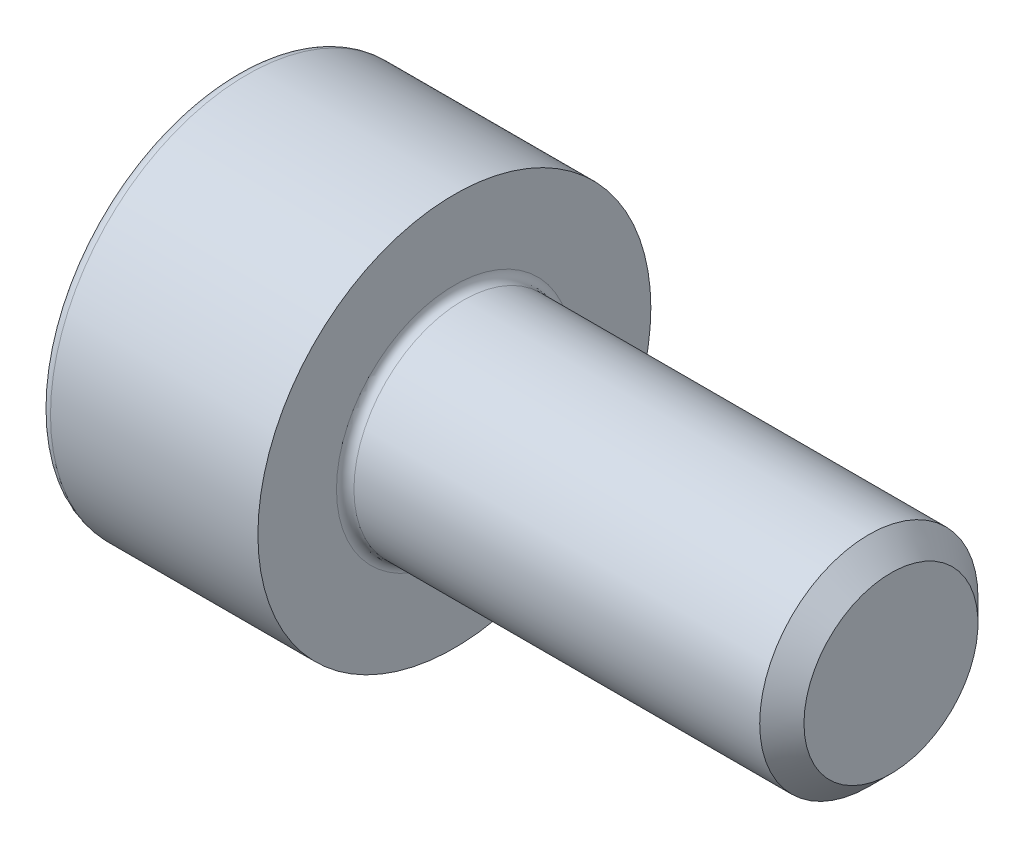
ISO-10303-21;
HEADER;
FILE_DESCRIPTION(('STEP AP214'),'2;1');
FILE_NAME('part.step','',(''),(''),'','','');
FILE_SCHEMA(('AUTOMOTIVE_DESIGN { 1 0 10303 214 1 1 1 1 }'));
ENDSEC;
DATA;
#1=APPLICATION_CONTEXT('core data for automotive mechanical design processes');
#2=APPLICATION_PROTOCOL_DEFINITION('international standard','automotive_design',2000,#1);
#3=PRODUCT_CONTEXT('',#1,'mechanical');
#4=PRODUCT('Part','Part','',(#3));
#5=PRODUCT_RELATED_PRODUCT_CATEGORY('part','',(#4));
#6=PRODUCT_DEFINITION_FORMATION('','',#4);
#7=PRODUCT_DEFINITION_CONTEXT('part definition',#1,'design');
#8=PRODUCT_DEFINITION('design','',#6,#7);
#9=PRODUCT_DEFINITION_SHAPE('','',#8);
#10=(LENGTH_UNIT() NAMED_UNIT(*) SI_UNIT(.MILLI.,.METRE.));
#11=(NAMED_UNIT(*) PLANE_ANGLE_UNIT() SI_UNIT($,.RADIAN.));
#12=(NAMED_UNIT(*) SI_UNIT($,.STERADIAN.) SOLID_ANGLE_UNIT());
#13=UNCERTAINTY_MEASURE_WITH_UNIT(LENGTH_MEASURE(1.E-05),#10,'distance_accuracy_value','');
#14=(GEOMETRIC_REPRESENTATION_CONTEXT(3) GLOBAL_UNCERTAINTY_ASSIGNED_CONTEXT((#13)) GLOBAL_UNIT_ASSIGNED_CONTEXT((#10,
#11,#12)) REPRESENTATION_CONTEXT('',''));
#15=CARTESIAN_POINT('',(0.,0.,0.));
#16=DIRECTION('',(0.,0.,1.));
#17=DIRECTION('',(1.,0.,0.));
#18=AXIS2_PLACEMENT_3D('',#15,#16,#17);
#19=CARTESIAN_POINT('',(0.,0.,0.));
#20=DIRECTION('',(-1.,0.,0.));
#21=DIRECTION('',(0.,0.,1.));
#22=AXIS2_PLACEMENT_3D('',#19,#20,#21);
#23=PLANE('',#22);
#24=DIRECTION('',(0.,-0.499999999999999,0.866025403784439));
#25=VECTOR('',#24,1.);
#26=CARTESIAN_POINT('',(0.,1.18068130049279,0.));
#27=LINE('',#26,#25);
#28=CARTESIAN_POINT('',(0.,1.18068130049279,0.));
#29=VERTEX_POINT('',#28);
#30=CARTESIAN_POINT('',(0.,0.590340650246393,1.02249999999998));
#31=VERTEX_POINT('',#30);
#32=EDGE_CURVE('E116',#29,#31,#27,.T.);
#33=ORIENTED_EDGE('',*,*,#32,.T.);
#34=DIRECTION('',(0.,1.,0.));
#35=VECTOR('',#34,1.);
#36=CARTESIAN_POINT('',(0.,-0.590340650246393,1.02249999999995));
#37=LINE('',#36,#35);
#38=CARTESIAN_POINT('',(0.,-0.590340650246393,1.02249999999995));
#39=VERTEX_POINT('',#38);
#40=EDGE_CURVE('E105',#39,#31,#37,.T.);
#41=ORIENTED_EDGE('',*,*,#40,.F.);
#42=DIRECTION('',(0.,-0.500000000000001,-0.866025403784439));
#43=VECTOR('',#42,1.);
#44=CARTESIAN_POINT('',(0.,-0.590340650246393,1.02249999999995));
#45=LINE('',#44,#43);
#46=CARTESIAN_POINT('',(0.,-1.18068130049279,0.));
#47=VERTEX_POINT('',#46);
#48=EDGE_CURVE('E115',#39,#47,#45,.T.);
#49=ORIENTED_EDGE('',*,*,#48,.T.);
#50=DIRECTION('',(0.,0.499999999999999,-0.866025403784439));
#51=VECTOR('',#50,1.);
#52=CARTESIAN_POINT('',(0.,-1.18068130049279,0.));
#53=LINE('',#52,#51);
#54=CARTESIAN_POINT('',(0.,-0.590340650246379,-1.02250000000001));
#55=VERTEX_POINT('',#54);
#56=EDGE_CURVE('E134',#47,#55,#53,.T.);
#57=ORIENTED_EDGE('',*,*,#56,.T.);
#58=DIRECTION('',(0.,-1.,0.));
#59=VECTOR('',#58,1.);
#60=CARTESIAN_POINT('',(0.,0.590340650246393,-1.02250000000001));
#61=LINE('',#60,#59);
#62=CARTESIAN_POINT('',(0.,0.590340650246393,-1.02250000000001));
#63=VERTEX_POINT('',#62);
#64=EDGE_CURVE('E137',#63,#55,#61,.T.);
#65=ORIENTED_EDGE('',*,*,#64,.F.);
#66=DIRECTION('',(0.,-0.500000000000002,-0.866025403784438));
#67=VECTOR('',#66,1.);
#68=CARTESIAN_POINT('',(0.,1.18068130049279,0.));
#69=LINE('',#68,#67);
#70=EDGE_CURVE('E130',#29,#63,#69,.T.);
#71=ORIENTED_EDGE('',*,*,#70,.F.);
#72=EDGE_LOOP('',(#33,#41,#49,#57,#65,#71));
#73=FACE_BOUND('',#72,.T.);
#74=CARTESIAN_POINT('',(0.,0.,0.));
#75=DIRECTION('',(-1.,0.,0.));
#76=DIRECTION('',(0.,0.,1.));
#77=AXIS2_PLACEMENT_3D('',#74,#75,#76);
#78=CIRCLE('',#77,2.125);
#79=CARTESIAN_POINT('',(0.,0.,2.125));
#80=VERTEX_POINT('',#79);
#81=EDGE_CURVE('E41',#80,#80,#78,.T.);
#82=ORIENTED_EDGE('',*,*,#81,.T.);
#83=EDGE_LOOP('',(#82));
#84=FACE_BOUND('',#83,.T.);
#85=ADVANCED_FACE('F34',(#73,#84),#23,.T.);
#86=CARTESIAN_POINT('',(-31.75,0.,0.));
#87=DIRECTION('',(-1.,0.,0.));
#88=DIRECTION('',(0.,0.,1.));
#89=AXIS2_PLACEMENT_3D('',#86,#87,#88);
#90=CYLINDRICAL_SURFACE('',#89,2.25);
#91=CARTESIAN_POINT('',(0.125000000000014,0.,0.));
#92=DIRECTION('',(-1.,0.,0.));
#93=DIRECTION('',(0.,0.,1.));
#94=AXIS2_PLACEMENT_3D('',#91,#92,#93);
#95=CIRCLE('',#94,2.25);
#96=CARTESIAN_POINT('',(0.125000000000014,0.,2.25));
#97=VERTEX_POINT('',#96);
#98=EDGE_CURVE('E11',#97,#97,#95,.F.);
#99=ORIENTED_EDGE('',*,*,#98,.T.);
#100=EDGE_LOOP('',(#99));
#101=FACE_BOUND('',#100,.T.);
#102=CARTESIAN_POINT('',(2.5,0.,0.));
#103=DIRECTION('',(-1.,0.,0.));
#104=DIRECTION('',(0.,0.,1.));
#105=AXIS2_PLACEMENT_3D('',#102,#103,#104);
#106=CIRCLE('',#105,2.25);
#107=CARTESIAN_POINT('',(2.5,0.,2.25));
#108=VERTEX_POINT('',#107);
#109=EDGE_CURVE('E182',#108,#108,#106,.T.);
#110=ORIENTED_EDGE('',*,*,#109,.T.);
#111=EDGE_LOOP('',(#110));
#112=FACE_BOUND('',#111,.T.);
#113=ADVANCED_FACE('F209',(#101,#112),#90,.T.);
#114=CARTESIAN_POINT('',(2.5,2.25,0.));
#115=DIRECTION('',(1.,0.,0.));
#116=DIRECTION('',(0.,0.,-1.));
#117=AXIS2_PLACEMENT_3D('',#114,#115,#116);
#118=PLANE('',#117);
#119=CARTESIAN_POINT('',(2.5,0.,0.));
#120=DIRECTION('',(1.,0.,0.));
#121=DIRECTION('',(0.,0.,-1.));
#122=AXIS2_PLACEMENT_3D('',#119,#120,#121);
#123=CIRCLE('',#122,1.35);
#124=CARTESIAN_POINT('',(2.5,0.,-1.35));
#125=VERTEX_POINT('',#124);
#126=EDGE_CURVE('E185',#125,#125,#123,.F.);
#127=ORIENTED_EDGE('',*,*,#126,.T.);
#128=EDGE_LOOP('',(#127));
#129=FACE_BOUND('',#128,.T.);
#130=ORIENTED_EDGE('',*,*,#109,.F.);
#131=EDGE_LOOP('',(#130));
#132=FACE_BOUND('',#131,.T.);
#133=ADVANCED_FACE('F213',(#129,#132),#118,.T.);
#134=CARTESIAN_POINT('',(-31.75,0.,0.));
#135=DIRECTION('',(-1.,0.,0.));
#136=DIRECTION('',(0.,0.,1.));
#137=AXIS2_PLACEMENT_3D('',#134,#135,#136);
#138=CYLINDRICAL_SURFACE('',#137,1.25);
#139=CARTESIAN_POINT('',(2.59999999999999,0.,0.));
#140=DIRECTION('',(1.,0.,0.));
#141=DIRECTION('',(0.,0.,-1.));
#142=AXIS2_PLACEMENT_3D('',#139,#140,#141);
#143=CIRCLE('',#142,1.25);
#144=CARTESIAN_POINT('',(2.59999999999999,0.,-1.25));
#145=VERTEX_POINT('',#144);
#146=EDGE_CURVE('E188',#145,#145,#143,.T.);
#147=ORIENTED_EDGE('',*,*,#146,.T.);
#148=EDGE_LOOP('',(#147));
#149=FACE_BOUND('',#148,.T.);
#150=CARTESIAN_POINT('',(7.24649999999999,0.,0.));
#151=DIRECTION('',(-1.,0.,0.));
#152=DIRECTION('',(0.,0.,1.));
#153=AXIS2_PLACEMENT_3D('',#150,#151,#152);
#154=CIRCLE('',#153,1.25);
#155=CARTESIAN_POINT('',(7.24649999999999,0.,1.25));
#156=VERTEX_POINT('',#155);
#157=EDGE_CURVE('E179',#156,#156,#154,.T.);
#158=ORIENTED_EDGE('',*,*,#157,.T.);
#159=EDGE_LOOP('',(#158));
#160=FACE_BOUND('',#159,.T.);
#161=ADVANCED_FACE('F218',(#149,#160),#138,.T.);
#162=CARTESIAN_POINT('',(7.50000000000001,0.,0.));
#163=DIRECTION('',(-1.,0.,0.));
#164=DIRECTION('',(0.,0.,1.));
#165=AXIS2_PLACEMENT_3D('',#162,#163,#164);
#166=CONICAL_SURFACE('',#165,0.9965,0.785398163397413);
#167=ORIENTED_EDGE('',*,*,#157,.F.);
#168=EDGE_LOOP('',(#167));
#169=FACE_BOUND('',#168,.T.);
#170=CARTESIAN_POINT('',(7.50000000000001,0.,0.));
#171=DIRECTION('',(-1.,0.,0.));
#172=DIRECTION('',(0.,0.,1.));
#173=AXIS2_PLACEMENT_3D('',#170,#171,#172);
#174=CIRCLE('',#173,0.9965);
#175=CARTESIAN_POINT('',(7.50000000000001,0.,0.996500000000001));
#176=VERTEX_POINT('',#175);
#177=EDGE_CURVE('E175',#176,#176,#174,.T.);
#178=ORIENTED_EDGE('',*,*,#177,.T.);
#179=EDGE_LOOP('',(#178));
#180=FACE_BOUND('',#179,.T.);
#181=ADVANCED_FACE('F225',(#169,#180),#166,.T.);
#182=CARTESIAN_POINT('',(7.50000000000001,0.996500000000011,0.));
#183=DIRECTION('',(1.,0.,0.));
#184=DIRECTION('',(0.,0.,-1.));
#185=AXIS2_PLACEMENT_3D('',#182,#183,#184);
#186=PLANE('',#185);
#187=ORIENTED_EDGE('',*,*,#177,.F.);
#188=EDGE_LOOP('',(#187));
#189=FACE_BOUND('',#188,.T.);
#190=ADVANCED_FACE('F203',(#189),#186,.T.);
#191=CARTESIAN_POINT('',(2.59999999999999,0.,0.));
#192=DIRECTION('',(1.,0.,0.));
#193=DIRECTION('',(0.,0.,-1.));
#194=AXIS2_PLACEMENT_3D('',#191,#192,#193);
#195=TOROIDAL_SURFACE('',#194,1.35,0.1);
#196=ORIENTED_EDGE('',*,*,#146,.F.);
#197=EDGE_LOOP('',(#196));
#198=FACE_BOUND('',#197,.T.);
#199=ORIENTED_EDGE('',*,*,#126,.F.);
#200=EDGE_LOOP('',(#199));
#201=FACE_BOUND('',#200,.T.);
#202=ADVANCED_FACE('F195',(#198,#201),#195,.F.);
#203=CARTESIAN_POINT('',(0.125000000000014,0.,0.));
#204=DIRECTION('',(-1.,0.,0.));
#205=DIRECTION('',(0.,0.,1.));
#206=AXIS2_PLACEMENT_3D('',#203,#204,#205);
#207=TOROIDAL_SURFACE('',#206,2.125,0.125);
#208=ORIENTED_EDGE('',*,*,#98,.F.);
#209=EDGE_LOOP('',(#208));
#210=FACE_BOUND('',#209,.T.);
#211=ORIENTED_EDGE('',*,*,#81,.F.);
#212=EDGE_LOOP('',(#211));
#213=FACE_BOUND('',#212,.T.);
#214=ADVANCED_FACE('F193',(#210,#213),#207,.T.);
#215=CARTESIAN_POINT('',(1.09999999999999,1.18068130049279,0.));
#216=DIRECTION('',(0.,-0.866025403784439,-0.5));
#217=DIRECTION('',(0.,0.499999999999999,-0.86602540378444));
#218=AXIS2_PLACEMENT_3D('',#215,#216,#217);
#219=PLANE('',#218);
#220=ORIENTED_EDGE('',*,*,#32,.F.);
#221=DIRECTION('',(-1.,0.,0.));
#222=VECTOR('',#221,1.);
#223=CARTESIAN_POINT('',(1.09999999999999,1.18068130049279,0.));
#224=LINE('',#223,#222);
#225=CARTESIAN_POINT('',(1.09999999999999,1.18068130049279,0.));
#226=VERTEX_POINT('',#225);
#227=EDGE_CURVE('E160',#226,#29,#224,.T.);
#228=ORIENTED_EDGE('',*,*,#227,.F.);
#229=DIRECTION('',(0.,-0.499999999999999,0.866025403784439));
#230=VECTOR('',#229,1.);
#231=CARTESIAN_POINT('',(1.09999999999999,1.18068130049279,0.));
#232=LINE('',#231,#230);
#233=CARTESIAN_POINT('',(1.09999999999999,0.885510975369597,0.511250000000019));
#234=VERTEX_POINT('',#233);
#235=EDGE_CURVE('E140',#226,#234,#232,.T.);
#236=ORIENTED_EDGE('',*,*,#235,.T.);
#237=CARTESIAN_POINT('',(1.09999999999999,0.590340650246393,1.02249999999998));
#238=VERTEX_POINT('',#237);
#239=EDGE_CURVE('E124',#234,#238,#232,.T.);
#240=ORIENTED_EDGE('',*,*,#239,.T.);
#241=DIRECTION('',(-1.,0.,0.));
#242=VECTOR('',#241,1.);
#243=CARTESIAN_POINT('',(1.09999999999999,0.590340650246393,1.02249999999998));
#244=LINE('',#243,#242);
#245=EDGE_CURVE('E109',#238,#31,#244,.T.);
#246=ORIENTED_EDGE('',*,*,#245,.T.);
#247=EDGE_LOOP('',(#220,#228,#236,#240,#246));
#248=FACE_BOUND('',#247,.T.);
#249=ADVANCED_FACE('F120',(#248),#219,.T.);
#250=CARTESIAN_POINT('',(1.09999999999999,-0.590340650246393,1.02249999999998));
#251=DIRECTION('',(0.,0.,1.));
#252=DIRECTION('',(0.,-1.,0.));
#253=AXIS2_PLACEMENT_3D('',#250,#251,#252);
#254=PLANE('',#253);
#255=ORIENTED_EDGE('',*,*,#40,.T.);
#256=ORIENTED_EDGE('',*,*,#245,.F.);
#257=DIRECTION('',(0.,1.,0.));
#258=VECTOR('',#257,1.);
#259=CARTESIAN_POINT('',(1.09999999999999,-0.590340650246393,1.02249999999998));
#260=LINE('',#259,#258);
#261=CARTESIAN_POINT('',(1.09999999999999,0.,1.02249999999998));
#262=VERTEX_POINT('',#261);
#263=EDGE_CURVE('E142',#262,#238,#260,.T.);
#264=ORIENTED_EDGE('',*,*,#263,.F.);
#265=CARTESIAN_POINT('',(1.09999999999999,-0.590340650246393,1.02249999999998));
#266=VERTEX_POINT('',#265);
#267=EDGE_CURVE('E143',#266,#262,#260,.T.);
#268=ORIENTED_EDGE('',*,*,#267,.F.);
#269=DIRECTION('',(-1.,0.,0.));
#270=VECTOR('',#269,1.);
#271=CARTESIAN_POINT('',(1.09999999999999,-0.590340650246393,1.02249999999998));
#272=LINE('',#271,#270);
#273=EDGE_CURVE('E111',#266,#39,#272,.T.);
#274=ORIENTED_EDGE('',*,*,#273,.T.);
#275=EDGE_LOOP('',(#255,#256,#264,#268,#274));
#276=FACE_BOUND('',#275,.T.);
#277=ADVANCED_FACE('F107',(#276),#254,.F.);
#278=CARTESIAN_POINT('',(1.09999999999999,-0.590340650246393,1.02249999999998));
#279=DIRECTION('',(0.,0.866025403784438,-0.500000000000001));
#280=DIRECTION('',(0.,0.500000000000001,0.866025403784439));
#281=AXIS2_PLACEMENT_3D('',#278,#279,#280);
#282=PLANE('',#281);
#283=ORIENTED_EDGE('',*,*,#48,.F.);
#284=ORIENTED_EDGE('',*,*,#273,.F.);
#285=DIRECTION('',(0.,-0.500000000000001,-0.866025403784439));
#286=VECTOR('',#285,1.);
#287=CARTESIAN_POINT('',(1.09999999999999,-0.590340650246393,1.02249999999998));
#288=LINE('',#287,#286);
#289=CARTESIAN_POINT('',(1.09999999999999,-0.885510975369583,0.511250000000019));
#290=VERTEX_POINT('',#289);
#291=EDGE_CURVE('E147',#266,#290,#288,.T.);
#292=ORIENTED_EDGE('',*,*,#291,.T.);
#293=CARTESIAN_POINT('',(1.09999999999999,-1.18068130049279,0.));
#294=VERTEX_POINT('',#293);
#295=EDGE_CURVE('E146',#290,#294,#288,.T.);
#296=ORIENTED_EDGE('',*,*,#295,.T.);
#297=DIRECTION('',(-1.,0.,0.));
#298=VECTOR('',#297,1.);
#299=CARTESIAN_POINT('',(1.09999999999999,-1.18068130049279,0.));
#300=LINE('',#299,#298);
#301=EDGE_CURVE('E168',#294,#47,#300,.T.);
#302=ORIENTED_EDGE('',*,*,#301,.T.);
#303=EDGE_LOOP('',(#283,#284,#292,#296,#302));
#304=FACE_BOUND('',#303,.T.);
#305=ADVANCED_FACE('F263',(#304),#282,.T.);
#306=CARTESIAN_POINT('',(1.09999999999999,-1.18068130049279,0.));
#307=DIRECTION('',(0.,0.86602540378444,0.5));
#308=DIRECTION('',(0.,-0.499999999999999,0.86602540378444));
#309=AXIS2_PLACEMENT_3D('',#306,#307,#308);
#310=PLANE('',#309);
#311=ORIENTED_EDGE('',*,*,#56,.F.);
#312=ORIENTED_EDGE('',*,*,#301,.F.);
#313=DIRECTION('',(0.,0.499999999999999,-0.866025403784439));
#314=VECTOR('',#313,1.);
#315=CARTESIAN_POINT('',(1.09999999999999,-1.18068130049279,0.));
#316=LINE('',#315,#314);
#317=CARTESIAN_POINT('',(1.09999999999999,-0.885510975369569,-0.511250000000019));
#318=VERTEX_POINT('',#317);
#319=EDGE_CURVE('E151',#294,#318,#316,.T.);
#320=ORIENTED_EDGE('',*,*,#319,.T.);
#321=CARTESIAN_POINT('',(1.09999999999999,-0.590340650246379,-1.02250000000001));
#322=VERTEX_POINT('',#321);
#323=EDGE_CURVE('E150',#318,#322,#316,.T.);
#324=ORIENTED_EDGE('',*,*,#323,.T.);
#325=DIRECTION('',(-1.,0.,0.));
#326=VECTOR('',#325,1.);
#327=CARTESIAN_POINT('',(1.09999999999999,-0.590340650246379,-1.02250000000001));
#328=LINE('',#327,#326);
#329=EDGE_CURVE('E165',#322,#55,#328,.T.);
#330=ORIENTED_EDGE('',*,*,#329,.T.);
#331=EDGE_LOOP('',(#311,#312,#320,#324,#330));
#332=FACE_BOUND('',#331,.T.);
#333=ADVANCED_FACE('F272',(#332),#310,.T.);
#334=CARTESIAN_POINT('',(1.09999999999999,0.590340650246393,-1.02250000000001));
#335=DIRECTION('',(0.,0.,-1.));
#336=DIRECTION('',(0.,1.,0.));
#337=AXIS2_PLACEMENT_3D('',#334,#335,#336);
#338=PLANE('',#337);
#339=ORIENTED_EDGE('',*,*,#64,.T.);
#340=ORIENTED_EDGE('',*,*,#329,.F.);
#341=DIRECTION('',(0.,-1.,0.));
#342=VECTOR('',#341,1.);
#343=CARTESIAN_POINT('',(1.09999999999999,0.590340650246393,-1.02250000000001));
#344=LINE('',#343,#342);
#345=CARTESIAN_POINT('',(1.09999999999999,0.,-1.02249999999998));
#346=VERTEX_POINT('',#345);
#347=EDGE_CURVE('E154',#346,#322,#344,.T.);
#348=ORIENTED_EDGE('',*,*,#347,.F.);
#349=CARTESIAN_POINT('',(1.09999999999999,0.590340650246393,-1.02250000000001));
#350=VERTEX_POINT('',#349);
#351=EDGE_CURVE('E48',#350,#346,#344,.T.);
#352=ORIENTED_EDGE('',*,*,#351,.F.);
#353=DIRECTION('',(-1.,0.,0.));
#354=VECTOR('',#353,1.);
#355=CARTESIAN_POINT('',(1.09999999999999,0.590340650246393,-1.02250000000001));
#356=LINE('',#355,#354);
#357=EDGE_CURVE('E162',#350,#63,#356,.T.);
#358=ORIENTED_EDGE('',*,*,#357,.T.);
#359=EDGE_LOOP('',(#339,#340,#348,#352,#358));
#360=FACE_BOUND('',#359,.T.);
#361=ADVANCED_FACE('F282',(#360),#338,.F.);
#362=CARTESIAN_POINT('',(1.09999999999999,1.18068130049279,0.));
#363=DIRECTION('',(0.,0.866025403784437,-0.500000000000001));
#364=DIRECTION('',(0.,0.500000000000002,0.866025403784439));
#365=AXIS2_PLACEMENT_3D('',#362,#363,#364);
#366=PLANE('',#365);
#367=ORIENTED_EDGE('',*,*,#70,.T.);
#368=ORIENTED_EDGE('',*,*,#357,.F.);
#369=DIRECTION('',(0.,-0.500000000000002,-0.866025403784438));
#370=VECTOR('',#369,1.);
#371=CARTESIAN_POINT('',(1.09999999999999,1.18068130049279,0.));
#372=LINE('',#371,#370);
#373=CARTESIAN_POINT('',(1.09999999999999,0.885510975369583,-0.511249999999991));
#374=VERTEX_POINT('',#373);
#375=EDGE_CURVE('E156',#374,#350,#372,.T.);
#376=ORIENTED_EDGE('',*,*,#375,.F.);
#377=EDGE_CURVE('E157',#226,#374,#372,.T.);
#378=ORIENTED_EDGE('',*,*,#377,.F.);
#379=ORIENTED_EDGE('',*,*,#227,.T.);
#380=EDGE_LOOP('',(#367,#368,#376,#378,#379));
#381=FACE_BOUND('',#380,.T.);
#382=ADVANCED_FACE('F292',(#381),#366,.F.);
#383=CARTESIAN_POINT('',(1.09999999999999,1.18068130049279,0.));
#384=DIRECTION('',(1.,0.,0.));
#385=DIRECTION('',(0.,0.,-1.));
#386=AXIS2_PLACEMENT_3D('',#383,#384,#385);
#387=PLANE('',#386);
#388=ORIENTED_EDGE('',*,*,#347,.T.);
#389=ORIENTED_EDGE('',*,*,#323,.F.);
#390=CARTESIAN_POINT('',(1.09999999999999,0.,0.));
#391=DIRECTION('',(-1.,0.,0.));
#392=DIRECTION('',(0.,0.,1.));
#393=AXIS2_PLACEMENT_3D('',#390,#391,#392);
#394=CIRCLE('',#393,1.0225);
#395=EDGE_CURVE('E403',#346,#318,#394,.T.);
#396=ORIENTED_EDGE('',*,*,#395,.F.);
#397=EDGE_LOOP('',(#388,#389,#396));
#398=FACE_BOUND('',#397,.T.);
#399=ADVANCED_FACE('F302',(#398),#387,.F.);
#400=ORIENTED_EDGE('',*,*,#319,.F.);
#401=ORIENTED_EDGE('',*,*,#295,.F.);
#402=EDGE_CURVE('E401',#318,#290,#394,.T.);
#403=ORIENTED_EDGE('',*,*,#402,.F.);
#404=EDGE_LOOP('',(#400,#401,#403));
#405=FACE_BOUND('',#404,.T.);
#406=ADVANCED_FACE('F312',(#405),#387,.F.);
#407=ORIENTED_EDGE('',*,*,#291,.F.);
#408=ORIENTED_EDGE('',*,*,#267,.T.);
#409=EDGE_CURVE('E125',#290,#262,#394,.T.);
#410=ORIENTED_EDGE('',*,*,#409,.F.);
#411=EDGE_LOOP('',(#407,#408,#410));
#412=FACE_BOUND('',#411,.T.);
#413=ADVANCED_FACE('F323',(#412),#387,.F.);
#414=ORIENTED_EDGE('',*,*,#263,.T.);
#415=ORIENTED_EDGE('',*,*,#239,.F.);
#416=EDGE_CURVE('E172',#262,#234,#394,.T.);
#417=ORIENTED_EDGE('',*,*,#416,.F.);
#418=EDGE_LOOP('',(#414,#415,#417));
#419=FACE_BOUND('',#418,.T.);
#420=ADVANCED_FACE('F332',(#419),#387,.F.);
#421=ORIENTED_EDGE('',*,*,#235,.F.);
#422=ORIENTED_EDGE('',*,*,#377,.T.);
#423=EDGE_CURVE('E176',#234,#374,#394,.T.);
#424=ORIENTED_EDGE('',*,*,#423,.F.);
#425=EDGE_LOOP('',(#421,#422,#424));
#426=FACE_BOUND('',#425,.T.);
#427=ADVANCED_FACE('F341',(#426),#387,.F.);
#428=ORIENTED_EDGE('',*,*,#375,.T.);
#429=ORIENTED_EDGE('',*,*,#351,.T.);
#430=EDGE_CURVE('E406',#374,#346,#394,.T.);
#431=ORIENTED_EDGE('',*,*,#430,.F.);
#432=EDGE_LOOP('',(#428,#429,#431));
#433=FACE_BOUND('',#432,.T.);
#434=ADVANCED_FACE('F315',(#433),#387,.F.);
#435=CARTESIAN_POINT('',(1.09999999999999,0.,0.));
#436=DIRECTION('',(-1.,0.,0.));
#437=DIRECTION('',(0.,0.,1.));
#438=AXIS2_PLACEMENT_3D('',#435,#436,#437);
#439=CONICAL_SURFACE('',#438,1.0225,1.04719755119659);
#440=CARTESIAN_POINT('',(1.6903406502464,0.,0.));
#441=VERTEX_POINT('',#440);
#442=VERTEX_LOOP('',#441);
#443=FACE_BOUND('',#442,.T.);
#444=ORIENTED_EDGE('',*,*,#416,.T.);
#445=ORIENTED_EDGE('',*,*,#423,.T.);
#446=ORIENTED_EDGE('',*,*,#430,.T.);
#447=ORIENTED_EDGE('',*,*,#395,.T.);
#448=ORIENTED_EDGE('',*,*,#402,.T.);
#449=ORIENTED_EDGE('',*,*,#409,.T.);
#450=EDGE_LOOP('',(#444,#445,#446,#447,#448,#449));
#451=FACE_BOUND('',#450,.T.);
#452=ADVANCED_FACE('F358',(#443,#451),#439,.F.);
#453=CLOSED_SHELL('',(#85,#113,#133,#161,#181,#190,#202,#214,#249,#277,#305,#333,#361,#382,#399,
#406,#413,#420,#427,#434,#452));
#454=MANIFOLD_SOLID_BREP('B2',#453);
#455=ADVANCED_BREP_SHAPE_REPRESENTATION('',(#18,#454),#14);
#456=SHAPE_DEFINITION_REPRESENTATION(#9,#455);
ENDSEC;
END-ISO-10303-21;
